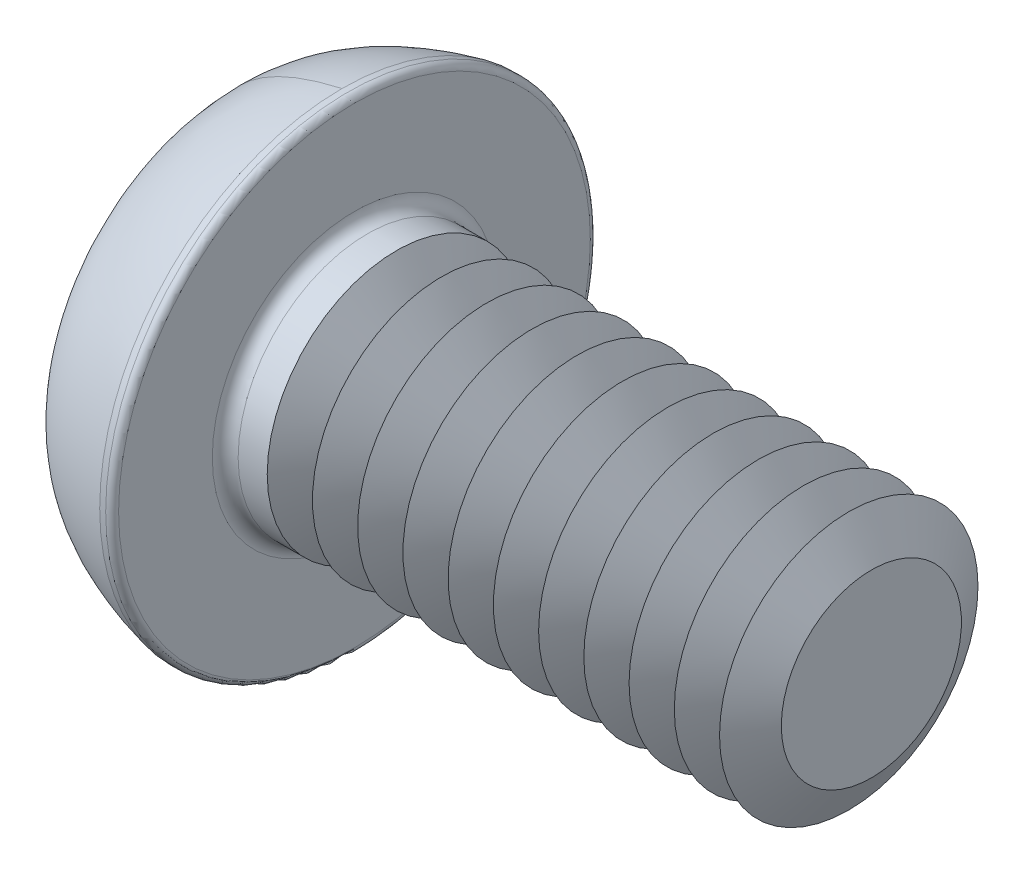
ISO-10303-21;
HEADER;
FILE_DESCRIPTION(('STEP AP214'),'2;1');
FILE_NAME('part.step','',(''),(''),'','','');
FILE_SCHEMA(('AUTOMOTIVE_DESIGN { 1 0 10303 214 1 1 1 1 }'));
ENDSEC;
DATA;
#1=APPLICATION_CONTEXT('core data for automotive mechanical design processes');
#2=APPLICATION_PROTOCOL_DEFINITION('international standard','automotive_design',2000,#1);
#3=PRODUCT_CONTEXT('',#1,'mechanical');
#4=PRODUCT('Part','Part','',(#3));
#5=PRODUCT_RELATED_PRODUCT_CATEGORY('part','',(#4));
#6=PRODUCT_DEFINITION_FORMATION('','',#4);
#7=PRODUCT_DEFINITION_CONTEXT('part definition',#1,'design');
#8=PRODUCT_DEFINITION('design','',#6,#7);
#9=PRODUCT_DEFINITION_SHAPE('','',#8);
#10=(LENGTH_UNIT() NAMED_UNIT(*) SI_UNIT(.MILLI.,.METRE.));
#11=(NAMED_UNIT(*) PLANE_ANGLE_UNIT() SI_UNIT($,.RADIAN.));
#12=(NAMED_UNIT(*) SI_UNIT($,.STERADIAN.) SOLID_ANGLE_UNIT());
#13=UNCERTAINTY_MEASURE_WITH_UNIT(LENGTH_MEASURE(1.E-05),#10,'distance_accuracy_value','');
#14=(GEOMETRIC_REPRESENTATION_CONTEXT(3) GLOBAL_UNCERTAINTY_ASSIGNED_CONTEXT((#13)) GLOBAL_UNIT_ASSIGNED_CONTEXT((#10,
#11,#12)) REPRESENTATION_CONTEXT('',''));
#15=CARTESIAN_POINT('',(0.,0.,0.));
#16=DIRECTION('',(0.,0.,1.));
#17=DIRECTION('',(1.,0.,0.));
#18=AXIS2_PLACEMENT_3D('',#15,#16,#17);
#19=CARTESIAN_POINT('',(0.,2.,0.));
#20=DIRECTION('',(-1.,0.,0.));
#21=DIRECTION('',(0.,0.,1.));
#22=AXIS2_PLACEMENT_3D('',#19,#20,#21);
#23=PLANE('',#22);
#24=CARTESIAN_POINT('',(0.,0.,0.));
#25=DIRECTION('',(-1.,0.,0.));
#26=DIRECTION('',(0.,0.,1.));
#27=AXIS2_PLACEMENT_3D('',#24,#25,#26);
#28=CIRCLE('',#27,1.39378221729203);
#29=CARTESIAN_POINT('',(0.,0.,1.39378221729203));
#30=VERTEX_POINT('',#29);
#31=EDGE_CURVE('E210',#30,#30,#28,.T.);
#32=ORIENTED_EDGE('',*,*,#31,.F.);
#33=EDGE_LOOP('',(#32));
#34=FACE_BOUND('',#33,.T.);
#35=ADVANCED_FACE('F16',(#34),#23,.F.);
#36=CARTESIAN_POINT('',(-0.35000000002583,0.,0.));
#37=DIRECTION('',(-1.,0.,0.));
#38=DIRECTION('',(0.,0.,1.));
#39=AXIS2_PLACEMENT_3D('',#36,#37,#38);
#40=CONICAL_SURFACE('',#39,1.99999999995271,1.04719755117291);
#41=CARTESIAN_POINT('',(-0.35000000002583,0.,0.));
#42=DIRECTION('',(1.,0.,0.));
#43=DIRECTION('',(0.,0.,-1.));
#44=AXIS2_PLACEMENT_3D('',#41,#42,#43);
#45=CIRCLE('',#44,1.99999999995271);
#46=CARTESIAN_POINT('',(-0.35000000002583,0.,-1.99999999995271));
#47=VERTEX_POINT('',#46);
#48=EDGE_CURVE('E207',#47,#47,#45,.F.);
#49=ORIENTED_EDGE('',*,*,#48,.F.);
#50=EDGE_LOOP('',(#49));
#51=FACE_BOUND('',#50,.T.);
#52=ORIENTED_EDGE('',*,*,#31,.T.);
#53=EDGE_LOOP('',(#52));
#54=FACE_BOUND('',#53,.T.);
#55=ADVANCED_FACE('F600',(#51,#54),#40,.T.);
#56=CARTESIAN_POINT('',(-0.35000000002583,0.,0.));
#57=DIRECTION('',(1.,0.,0.));
#58=DIRECTION('',(0.,0.,-1.));
#59=AXIS2_PLACEMENT_3D('',#56,#57,#58);
#60=CONICAL_SURFACE('',#59,1.99999999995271,1.04719755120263);
#61=ORIENTED_EDGE('',*,*,#48,.T.);
#62=EDGE_LOOP('',(#61));
#63=FACE_BOUND('',#62,.T.);
#64=CARTESIAN_POINT('',(-0.699999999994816,0.,0.));
#65=DIRECTION('',(-1.,0.,0.));
#66=DIRECTION('',(0.,0.,1.));
#67=AXIS2_PLACEMENT_3D('',#64,#65,#66);
#68=CIRCLE('',#67,1.39378221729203);
#69=CARTESIAN_POINT('',(-0.699999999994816,0.,1.39378221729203));
#70=VERTEX_POINT('',#69);
#71=EDGE_CURVE('E204',#70,#70,#68,.T.);
#72=ORIENTED_EDGE('',*,*,#71,.F.);
#73=EDGE_LOOP('',(#72));
#74=FACE_BOUND('',#73,.T.);
#75=ADVANCED_FACE('F597',(#63,#74),#60,.T.);
#76=CARTESIAN_POINT('',(-1.05000000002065,0.,0.));
#77=DIRECTION('',(-1.,0.,0.));
#78=DIRECTION('',(0.,0.,1.));
#79=AXIS2_PLACEMENT_3D('',#76,#77,#78);
#80=CONICAL_SURFACE('',#79,1.99999999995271,1.04719755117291);
#81=CARTESIAN_POINT('',(-1.05000000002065,0.,0.));
#82=DIRECTION('',(1.,0.,0.));
#83=DIRECTION('',(0.,0.,-1.));
#84=AXIS2_PLACEMENT_3D('',#81,#82,#83);
#85=CIRCLE('',#84,1.99999999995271);
#86=CARTESIAN_POINT('',(-1.05000000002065,0.,-1.99999999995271));
#87=VERTEX_POINT('',#86);
#88=EDGE_CURVE('E201',#87,#87,#85,.F.);
#89=ORIENTED_EDGE('',*,*,#88,.F.);
#90=EDGE_LOOP('',(#89));
#91=FACE_BOUND('',#90,.T.);
#92=ORIENTED_EDGE('',*,*,#71,.T.);
#93=EDGE_LOOP('',(#92));
#94=FACE_BOUND('',#93,.T.);
#95=ADVANCED_FACE('F593',(#91,#94),#80,.T.);
#96=CARTESIAN_POINT('',(-1.05000000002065,0.,0.));
#97=DIRECTION('',(1.,0.,0.));
#98=DIRECTION('',(0.,0.,-1.));
#99=AXIS2_PLACEMENT_3D('',#96,#97,#98);
#100=CONICAL_SURFACE('',#99,1.99999999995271,1.04719755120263);
#101=ORIENTED_EDGE('',*,*,#88,.T.);
#102=EDGE_LOOP('',(#101));
#103=FACE_BOUND('',#102,.T.);
#104=CARTESIAN_POINT('',(-1.39999999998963,0.,0.));
#105=DIRECTION('',(-1.,0.,0.));
#106=DIRECTION('',(0.,0.,1.));
#107=AXIS2_PLACEMENT_3D('',#104,#105,#106);
#108=CIRCLE('',#107,1.39378221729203);
#109=CARTESIAN_POINT('',(-1.39999999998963,0.,1.39378221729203));
#110=VERTEX_POINT('',#109);
#111=EDGE_CURVE('E198',#110,#110,#108,.T.);
#112=ORIENTED_EDGE('',*,*,#111,.F.);
#113=EDGE_LOOP('',(#112));
#114=FACE_BOUND('',#113,.T.);
#115=ADVANCED_FACE('F589',(#103,#114),#100,.T.);
#116=CARTESIAN_POINT('',(-1.75000000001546,0.,0.));
#117=DIRECTION('',(-1.,0.,0.));
#118=DIRECTION('',(0.,0.,1.));
#119=AXIS2_PLACEMENT_3D('',#116,#117,#118);
#120=CONICAL_SURFACE('',#119,1.99999999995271,1.04719755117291);
#121=CARTESIAN_POINT('',(-1.75000000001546,0.,0.));
#122=DIRECTION('',(1.,0.,0.));
#123=DIRECTION('',(0.,0.,-1.));
#124=AXIS2_PLACEMENT_3D('',#121,#122,#123);
#125=CIRCLE('',#124,1.99999999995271);
#126=CARTESIAN_POINT('',(-1.75000000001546,0.,-1.99999999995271));
#127=VERTEX_POINT('',#126);
#128=EDGE_CURVE('E195',#127,#127,#125,.F.);
#129=ORIENTED_EDGE('',*,*,#128,.F.);
#130=EDGE_LOOP('',(#129));
#131=FACE_BOUND('',#130,.T.);
#132=ORIENTED_EDGE('',*,*,#111,.T.);
#133=EDGE_LOOP('',(#132));
#134=FACE_BOUND('',#133,.T.);
#135=ADVANCED_FACE('F585',(#131,#134),#120,.T.);
#136=CARTESIAN_POINT('',(-1.75000000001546,0.,0.));
#137=DIRECTION('',(1.,0.,0.));
#138=DIRECTION('',(0.,0.,-1.));
#139=AXIS2_PLACEMENT_3D('',#136,#137,#138);
#140=CONICAL_SURFACE('',#139,1.99999999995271,1.04719755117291);
#141=ORIENTED_EDGE('',*,*,#128,.T.);
#142=EDGE_LOOP('',(#141));
#143=FACE_BOUND('',#142,.T.);
#144=CARTESIAN_POINT('',(-2.10000000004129,0.,0.));
#145=DIRECTION('',(-1.,0.,0.));
#146=DIRECTION('',(0.,0.,1.));
#147=AXIS2_PLACEMENT_3D('',#144,#145,#146);
#148=CIRCLE('',#147,1.39378221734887);
#149=CARTESIAN_POINT('',(-2.10000000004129,0.,1.39378221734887));
#150=VERTEX_POINT('',#149);
#151=EDGE_CURVE('E192',#150,#150,#148,.T.);
#152=ORIENTED_EDGE('',*,*,#151,.F.);
#153=EDGE_LOOP('',(#152));
#154=FACE_BOUND('',#153,.T.);
#155=ADVANCED_FACE('F581',(#143,#154),#140,.T.);
#156=CARTESIAN_POINT('',(-2.45000000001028,0.,0.));
#157=DIRECTION('',(-1.,0.,0.));
#158=DIRECTION('',(0.,0.,1.));
#159=AXIS2_PLACEMENT_3D('',#156,#157,#158);
#160=CONICAL_SURFACE('',#159,1.99999999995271,1.04719755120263);
#161=CARTESIAN_POINT('',(-2.45000000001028,0.,0.));
#162=DIRECTION('',(1.,0.,0.));
#163=DIRECTION('',(0.,0.,-1.));
#164=AXIS2_PLACEMENT_3D('',#161,#162,#163);
#165=CIRCLE('',#164,1.99999999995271);
#166=CARTESIAN_POINT('',(-2.45000000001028,0.,-1.99999999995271));
#167=VERTEX_POINT('',#166);
#168=EDGE_CURVE('E189',#167,#167,#165,.F.);
#169=ORIENTED_EDGE('',*,*,#168,.F.);
#170=EDGE_LOOP('',(#169));
#171=FACE_BOUND('',#170,.T.);
#172=ORIENTED_EDGE('',*,*,#151,.T.);
#173=EDGE_LOOP('',(#172));
#174=FACE_BOUND('',#173,.T.);
#175=ADVANCED_FACE('F577',(#171,#174),#160,.T.);
#176=CARTESIAN_POINT('',(-2.45000000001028,0.,0.));
#177=DIRECTION('',(1.,0.,0.));
#178=DIRECTION('',(0.,0.,-1.));
#179=AXIS2_PLACEMENT_3D('',#176,#177,#178);
#180=CONICAL_SURFACE('',#179,1.99999999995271,1.04719755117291);
#181=ORIENTED_EDGE('',*,*,#168,.T.);
#182=EDGE_LOOP('',(#181));
#183=FACE_BOUND('',#182,.T.);
#184=CARTESIAN_POINT('',(-2.80000000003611,0.,0.));
#185=DIRECTION('',(-1.,0.,0.));
#186=DIRECTION('',(0.,0.,1.));
#187=AXIS2_PLACEMENT_3D('',#184,#185,#186);
#188=CIRCLE('',#187,1.39378221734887);
#189=CARTESIAN_POINT('',(-2.80000000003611,0.,1.39378221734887));
#190=VERTEX_POINT('',#189);
#191=EDGE_CURVE('E186',#190,#190,#188,.T.);
#192=ORIENTED_EDGE('',*,*,#191,.F.);
#193=EDGE_LOOP('',(#192));
#194=FACE_BOUND('',#193,.T.);
#195=ADVANCED_FACE('F573',(#183,#194),#180,.T.);
#196=CARTESIAN_POINT('',(-3.14999999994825,0.,0.));
#197=DIRECTION('',(-1.,0.,0.));
#198=DIRECTION('',(0.,0.,1.));
#199=AXIS2_PLACEMENT_3D('',#196,#197,#198);
#200=CONICAL_SURFACE('',#199,1.99999999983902,1.04719755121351);
#201=CARTESIAN_POINT('',(-3.15000000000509,0.,0.));
#202=DIRECTION('',(1.,0.,0.));
#203=DIRECTION('',(0.,0.,-1.));
#204=AXIS2_PLACEMENT_3D('',#201,#202,#203);
#205=CIRCLE('',#204,1.99999999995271);
#206=CARTESIAN_POINT('',(-3.15000000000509,0.,-1.99999999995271));
#207=VERTEX_POINT('',#206);
#208=EDGE_CURVE('E183',#207,#207,#205,.F.);
#209=ORIENTED_EDGE('',*,*,#208,.F.);
#210=EDGE_LOOP('',(#209));
#211=FACE_BOUND('',#210,.T.);
#212=ORIENTED_EDGE('',*,*,#191,.T.);
#213=EDGE_LOOP('',(#212));
#214=FACE_BOUND('',#213,.T.);
#215=ADVANCED_FACE('F569',(#211,#214),#200,.T.);
#216=CARTESIAN_POINT('',(-3.15000000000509,0.,0.));
#217=DIRECTION('',(1.,0.,0.));
#218=DIRECTION('',(0.,1.,0.));
#219=AXIS2_PLACEMENT_3D('',#216,#217,#218);
#220=CONICAL_SURFACE('',#219,1.99999999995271,1.04719755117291);
#221=ORIENTED_EDGE('',*,*,#208,.T.);
#222=EDGE_LOOP('',(#221));
#223=FACE_BOUND('',#222,.T.);
#224=CARTESIAN_POINT('',(-3.50000000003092,0.,0.));
#225=DIRECTION('',(-1.,0.,0.));
#226=DIRECTION('',(0.,0.,1.));
#227=AXIS2_PLACEMENT_3D('',#224,#225,#226);
#228=CIRCLE('',#227,1.39378221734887);
#229=CARTESIAN_POINT('',(-3.50000000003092,0.,1.39378221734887));
#230=VERTEX_POINT('',#229);
#231=EDGE_CURVE('E180',#230,#230,#228,.T.);
#232=ORIENTED_EDGE('',*,*,#231,.F.);
#233=EDGE_LOOP('',(#232));
#234=FACE_BOUND('',#233,.T.);
#235=ADVANCED_FACE('F565',(#223,#234),#220,.T.);
#236=CARTESIAN_POINT('',(-3.84999999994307,0.,0.));
#237=DIRECTION('',(-1.,0.,0.));
#238=DIRECTION('',(0.,-1.,0.));
#239=AXIS2_PLACEMENT_3D('',#236,#237,#238);
#240=CONICAL_SURFACE('',#239,1.99999999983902,1.04719755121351);
#241=CARTESIAN_POINT('',(-3.84999999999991,0.,0.));
#242=DIRECTION('',(1.,0.,0.));
#243=DIRECTION('',(0.,0.,-1.));
#244=AXIS2_PLACEMENT_3D('',#241,#242,#243);
#245=CIRCLE('',#244,2.00000000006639);
#246=CARTESIAN_POINT('',(-3.84999999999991,0.,-2.00000000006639));
#247=VERTEX_POINT('',#246);
#248=EDGE_CURVE('E177',#247,#247,#245,.F.);
#249=ORIENTED_EDGE('',*,*,#248,.F.);
#250=EDGE_LOOP('',(#249));
#251=FACE_BOUND('',#250,.T.);
#252=ORIENTED_EDGE('',*,*,#231,.T.);
#253=EDGE_LOOP('',(#252));
#254=FACE_BOUND('',#253,.T.);
#255=ADVANCED_FACE('F561',(#251,#254),#240,.T.);
#256=CARTESIAN_POINT('',(-3.85000000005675,0.,0.));
#257=DIRECTION('',(1.,0.,0.));
#258=DIRECTION('',(0.,0.,-1.));
#259=AXIS2_PLACEMENT_3D('',#256,#257,#258);
#260=CONICAL_SURFACE('',#259,1.99999999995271,1.04719755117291);
#261=ORIENTED_EDGE('',*,*,#248,.T.);
#262=EDGE_LOOP('',(#261));
#263=FACE_BOUND('',#262,.T.);
#264=CARTESIAN_POINT('',(-4.20000000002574,0.,0.));
#265=DIRECTION('',(-1.,0.,0.));
#266=DIRECTION('',(0.,0.,1.));
#267=AXIS2_PLACEMENT_3D('',#264,#265,#266);
#268=CIRCLE('',#267,1.39378221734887);
#269=CARTESIAN_POINT('',(-4.20000000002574,0.,1.39378221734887));
#270=VERTEX_POINT('',#269);
#271=EDGE_CURVE('E174',#270,#270,#268,.T.);
#272=ORIENTED_EDGE('',*,*,#271,.F.);
#273=EDGE_LOOP('',(#272));
#274=FACE_BOUND('',#273,.T.);
#275=ADVANCED_FACE('F557',(#263,#274),#260,.T.);
#276=CARTESIAN_POINT('',(-4.54999999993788,0.,0.));
#277=DIRECTION('',(-1.,0.,0.));
#278=DIRECTION('',(0.,0.,1.));
#279=AXIS2_PLACEMENT_3D('',#276,#277,#278);
#280=CONICAL_SURFACE('',#279,1.99999999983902,1.04719755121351);
#281=CARTESIAN_POINT('',(-4.54999999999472,0.,0.));
#282=DIRECTION('',(1.,0.,0.));
#283=DIRECTION('',(0.,0.,-1.));
#284=AXIS2_PLACEMENT_3D('',#281,#282,#283);
#285=CIRCLE('',#284,2.00000000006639);
#286=CARTESIAN_POINT('',(-4.54999999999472,0.,-2.00000000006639));
#287=VERTEX_POINT('',#286);
#288=EDGE_CURVE('E171',#287,#287,#285,.F.);
#289=ORIENTED_EDGE('',*,*,#288,.F.);
#290=EDGE_LOOP('',(#289));
#291=FACE_BOUND('',#290,.T.);
#292=ORIENTED_EDGE('',*,*,#271,.T.);
#293=EDGE_LOOP('',(#292));
#294=FACE_BOUND('',#293,.T.);
#295=ADVANCED_FACE('F553',(#291,#294),#280,.T.);
#296=CARTESIAN_POINT('',(-4.55000000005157,0.,0.));
#297=DIRECTION('',(1.,0.,0.));
#298=DIRECTION('',(0.,0.,-1.));
#299=AXIS2_PLACEMENT_3D('',#296,#297,#298);
#300=CONICAL_SURFACE('',#299,1.99999999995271,1.04719755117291);
#301=ORIENTED_EDGE('',*,*,#288,.T.);
#302=EDGE_LOOP('',(#301));
#303=FACE_BOUND('',#302,.T.);
#304=CARTESIAN_POINT('',(-4.90000000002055,0.,0.));
#305=DIRECTION('',(-1.,0.,0.));
#306=DIRECTION('',(0.,0.,1.));
#307=AXIS2_PLACEMENT_3D('',#304,#305,#306);
#308=CIRCLE('',#307,1.39378221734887);
#309=CARTESIAN_POINT('',(-4.90000000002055,0.,1.39378221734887));
#310=VERTEX_POINT('',#309);
#311=EDGE_CURVE('E168',#310,#310,#308,.T.);
#312=ORIENTED_EDGE('',*,*,#311,.F.);
#313=EDGE_LOOP('',(#312));
#314=FACE_BOUND('',#313,.T.);
#315=ADVANCED_FACE('F549',(#303,#314),#300,.T.);
#316=CARTESIAN_POINT('',(-5.2499999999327,0.,0.));
#317=DIRECTION('',(-1.,0.,0.));
#318=DIRECTION('',(0.,0.,1.));
#319=AXIS2_PLACEMENT_3D('',#316,#317,#318);
#320=CONICAL_SURFACE('',#319,1.99999999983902,1.04719755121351);
#321=CARTESIAN_POINT('',(-5.24999999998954,0.,0.));
#322=DIRECTION('',(1.,0.,0.));
#323=DIRECTION('',(0.,0.,-1.));
#324=AXIS2_PLACEMENT_3D('',#321,#322,#323);
#325=CIRCLE('',#324,2.00000000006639);
#326=CARTESIAN_POINT('',(-5.24999999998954,0.,-2.00000000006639));
#327=VERTEX_POINT('',#326);
#328=EDGE_CURVE('E165',#327,#327,#325,.F.);
#329=ORIENTED_EDGE('',*,*,#328,.F.);
#330=EDGE_LOOP('',(#329));
#331=FACE_BOUND('',#330,.T.);
#332=ORIENTED_EDGE('',*,*,#311,.T.);
#333=EDGE_LOOP('',(#332));
#334=FACE_BOUND('',#333,.T.);
#335=ADVANCED_FACE('F545',(#331,#334),#320,.T.);
#336=CARTESIAN_POINT('',(-5.25000000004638,0.,0.));
#337=DIRECTION('',(1.,0.,0.));
#338=DIRECTION('',(0.,0.,-1.));
#339=AXIS2_PLACEMENT_3D('',#336,#337,#338);
#340=CONICAL_SURFACE('',#339,1.99999999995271,1.04719755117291);
#341=ORIENTED_EDGE('',*,*,#328,.T.);
#342=EDGE_LOOP('',(#341));
#343=FACE_BOUND('',#342,.T.);
#344=CARTESIAN_POINT('',(-5.60000000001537,0.,0.));
#345=DIRECTION('',(-1.,0.,0.));
#346=DIRECTION('',(0.,0.,1.));
#347=AXIS2_PLACEMENT_3D('',#344,#345,#346);
#348=CIRCLE('',#347,1.39378221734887);
#349=CARTESIAN_POINT('',(-5.60000000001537,0.,1.39378221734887));
#350=VERTEX_POINT('',#349);
#351=EDGE_CURVE('E162',#350,#350,#348,.T.);
#352=ORIENTED_EDGE('',*,*,#351,.F.);
#353=EDGE_LOOP('',(#352));
#354=FACE_BOUND('',#353,.T.);
#355=ADVANCED_FACE('F541',(#343,#354),#340,.T.);
#356=CARTESIAN_POINT('',(-5.94999999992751,0.,0.));
#357=DIRECTION('',(-1.,0.,0.));
#358=DIRECTION('',(0.,0.,1.));
#359=AXIS2_PLACEMENT_3D('',#356,#357,#358);
#360=CONICAL_SURFACE('',#359,1.99999999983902,1.04719755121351);
#361=CARTESIAN_POINT('',(-5.9500000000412,0.,0.));
#362=DIRECTION('',(1.,0.,0.));
#363=DIRECTION('',(0.,0.,-1.));
#364=AXIS2_PLACEMENT_3D('',#361,#362,#363);
#365=CIRCLE('',#364,1.99999999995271);
#366=CARTESIAN_POINT('',(-5.9500000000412,0.,-1.99999999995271));
#367=VERTEX_POINT('',#366);
#368=EDGE_CURVE('E159',#367,#367,#365,.F.);
#369=ORIENTED_EDGE('',*,*,#368,.F.);
#370=EDGE_LOOP('',(#369));
#371=FACE_BOUND('',#370,.T.);
#372=ORIENTED_EDGE('',*,*,#351,.T.);
#373=EDGE_LOOP('',(#372));
#374=FACE_BOUND('',#373,.T.);
#375=ADVANCED_FACE('F537',(#371,#374),#360,.T.);
#376=CARTESIAN_POINT('',(-5.9500000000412,0.,0.));
#377=DIRECTION('',(1.,0.,0.));
#378=DIRECTION('',(0.,1.,0.));
#379=AXIS2_PLACEMENT_3D('',#376,#377,#378);
#380=CONICAL_SURFACE('',#379,1.99999999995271,1.04719755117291);
#381=ORIENTED_EDGE('',*,*,#368,.T.);
#382=EDGE_LOOP('',(#381));
#383=FACE_BOUND('',#382,.T.);
#384=CARTESIAN_POINT('',(-6.30000000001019,0.,0.));
#385=DIRECTION('',(-1.,0.,0.));
#386=DIRECTION('',(0.,0.,1.));
#387=AXIS2_PLACEMENT_3D('',#384,#385,#386);
#388=CIRCLE('',#387,1.39378221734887);
#389=CARTESIAN_POINT('',(-6.30000000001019,0.,1.39378221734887));
#390=VERTEX_POINT('',#389);
#391=EDGE_CURVE('E156',#390,#390,#388,.T.);
#392=ORIENTED_EDGE('',*,*,#391,.F.);
#393=EDGE_LOOP('',(#392));
#394=FACE_BOUND('',#393,.T.);
#395=ADVANCED_FACE('F531',(#383,#394),#380,.T.);
#396=CARTESIAN_POINT('',(-6.64999999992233,0.,0.));
#397=DIRECTION('',(-1.,0.,0.));
#398=DIRECTION('',(0.,0.,1.));
#399=AXIS2_PLACEMENT_3D('',#396,#397,#398);
#400=CONICAL_SURFACE('',#399,1.99999999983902,1.04719755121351);
#401=CARTESIAN_POINT('',(-6.65000000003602,0.,0.));
#402=DIRECTION('',(1.,0.,0.));
#403=DIRECTION('',(0.,0.,-1.));
#404=AXIS2_PLACEMENT_3D('',#401,#402,#403);
#405=CIRCLE('',#404,1.99999999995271);
#406=CARTESIAN_POINT('',(-6.65000000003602,0.,-1.99999999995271));
#407=VERTEX_POINT('',#406);
#408=EDGE_CURVE('E153',#407,#407,#405,.F.);
#409=ORIENTED_EDGE('',*,*,#408,.F.);
#410=EDGE_LOOP('',(#409));
#411=FACE_BOUND('',#410,.T.);
#412=ORIENTED_EDGE('',*,*,#391,.T.);
#413=EDGE_LOOP('',(#412));
#414=FACE_BOUND('',#413,.T.);
#415=ADVANCED_FACE('F525',(#411,#414),#400,.T.);
#416=CARTESIAN_POINT('',(-6.65000000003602,0.,0.));
#417=DIRECTION('',(1.,0.,0.));
#418=DIRECTION('',(0.,0.,-1.));
#419=AXIS2_PLACEMENT_3D('',#416,#417,#418);
#420=CONICAL_SURFACE('',#419,1.99999999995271,1.04719755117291);
#421=ORIENTED_EDGE('',*,*,#408,.T.);
#422=EDGE_LOOP('',(#421));
#423=FACE_BOUND('',#422,.T.);
#424=CARTESIAN_POINT('',(-7.000000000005,0.,0.));
#425=DIRECTION('',(-1.,0.,0.));
#426=DIRECTION('',(0.,0.,1.));
#427=AXIS2_PLACEMENT_3D('',#424,#425,#426);
#428=CIRCLE('',#427,1.39378221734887);
#429=CARTESIAN_POINT('',(-7.000000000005,0.,1.39378221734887));
#430=VERTEX_POINT('',#429);
#431=EDGE_CURVE('E150',#430,#430,#428,.T.);
#432=ORIENTED_EDGE('',*,*,#431,.F.);
#433=EDGE_LOOP('',(#432));
#434=FACE_BOUND('',#433,.T.);
#435=ADVANCED_FACE('F520',(#423,#434),#420,.T.);
#436=CARTESIAN_POINT('',(-7.34999999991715,0.,0.));
#437=DIRECTION('',(-1.,0.,0.));
#438=DIRECTION('',(0.,-1.,0.));
#439=AXIS2_PLACEMENT_3D('',#436,#437,#438);
#440=CONICAL_SURFACE('',#439,1.99999999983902,1.04719755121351);
#441=CARTESIAN_POINT('',(-7.35,0.,0.));
#442=DIRECTION('',(-1.,0.,0.));
#443=DIRECTION('',(0.,0.,1.));
#444=AXIS2_PLACEMENT_3D('',#441,#442,#443);
#445=CIRCLE('',#444,2.);
#446=CARTESIAN_POINT('',(-7.35,0.,2.));
#447=VERTEX_POINT('',#446);
#448=EDGE_CURVE('E147',#447,#447,#445,.T.);
#449=ORIENTED_EDGE('',*,*,#448,.F.);
#450=EDGE_LOOP('',(#449));
#451=FACE_BOUND('',#450,.T.);
#452=ORIENTED_EDGE('',*,*,#431,.T.);
#453=EDGE_LOOP('',(#452));
#454=FACE_BOUND('',#453,.T.);
#455=ADVANCED_FACE('F515',(#451,#454),#440,.T.);
#456=CARTESIAN_POINT('',(-10.2,0.,0.));
#457=DIRECTION('',(-1.,0.,0.));
#458=DIRECTION('',(0.,0.,1.));
#459=AXIS2_PLACEMENT_3D('',#456,#457,#458);
#460=CYLINDRICAL_SURFACE('',#459,2.);
#461=CARTESIAN_POINT('',(-7.8,0.,0.));
#462=DIRECTION('',(-1.,0.,0.));
#463=DIRECTION('',(0.,0.,1.));
#464=AXIS2_PLACEMENT_3D('',#461,#462,#463);
#465=CIRCLE('',#464,2.);
#466=CARTESIAN_POINT('',(-7.8,0.,2.));
#467=VERTEX_POINT('',#466);
#468=EDGE_CURVE('E112',#467,#467,#465,.F.);
#469=ORIENTED_EDGE('',*,*,#468,.T.);
#470=EDGE_LOOP('',(#469));
#471=FACE_BOUND('',#470,.T.);
#472=ORIENTED_EDGE('',*,*,#448,.T.);
#473=EDGE_LOOP('',(#472));
#474=FACE_BOUND('',#473,.T.);
#475=ADVANCED_FACE('F512',(#471,#474),#460,.T.);
#476=CARTESIAN_POINT('',(-8.90540000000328,0.,0.));
#477=DIRECTION('',(-1.,0.,0.));
#478=DIRECTION('',(0.,0.,1.));
#479=AXIS2_PLACEMENT_3D('',#476,#477,#478);
#480=CONICAL_SURFACE('',#479,1.45203592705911,1.01324881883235);
#481=CARTESIAN_POINT('',(-7.99999999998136,0.,8.5265128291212E-11));
#482=VERTEX_POINT('',#481);
#483=VERTEX_LOOP('',#482);
#484=FACE_BOUND('',#483,.T.);
#485=CARTESIAN_POINT('',(-8.8999999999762,1.44337567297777,6.42488806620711E-12));
#486=CARTESIAN_POINT('',(-8.88007872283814,1.41143450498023,-0.0553237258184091));
#487=CARTESIAN_POINT('',(-8.86194472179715,1.37917173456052,-0.111204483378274));
#488=CARTESIAN_POINT('',(-8.83031020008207,1.31399030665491,-0.224102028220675));
#489=CARTESIAN_POINT('',(-8.81682328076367,1.28107001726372,-0.281121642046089));
#490=CARTESIAN_POINT('',(-8.79597614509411,1.21570590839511,-0.394335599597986));
#491=CARTESIAN_POINT('',(-8.78845008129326,1.18327582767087,-0.45050614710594));
#492=CARTESIAN_POINT('',(-8.77965673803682,1.11824560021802,-0.563141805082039));
#493=CARTESIAN_POINT('',(-8.77838010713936,1.08564578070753,-0.619606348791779));
#494=CARTESIAN_POINT('',(-8.78191426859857,1.02531363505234,-0.724104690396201));
#495=CARTESIAN_POINT('',(-8.78586113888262,0.997567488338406,-0.772162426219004));
#496=CARTESIAN_POINT('',(-8.79808262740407,0.942287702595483,-0.867909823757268));
#497=CARTESIAN_POINT('',(-8.80636197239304,0.914754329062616,-0.915599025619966));
#498=CARTESIAN_POINT('',(-8.82695101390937,0.859348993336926,-1.01156388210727));
#499=CARTESIAN_POINT('',(-8.83935820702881,0.831486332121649,-1.05982342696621));
#500=CARTESIAN_POINT('',(-8.86741853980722,0.77623810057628,-1.15551617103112));
#501=CARTESIAN_POINT('',(-8.88306409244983,0.748851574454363,-1.20295102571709));
#502=CARTESIAN_POINT('',(-8.90000000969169,0.72168782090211,-1.25000002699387));
#503=B_SPLINE_CURVE_WITH_KNOTS('',3,(#485,#486,#487,#488,#489,#490,#491,#492,#493,#494,#495,
#496,#497,#498,#499,#500,#501,#502),.UNSPECIFIED.,.F.,.F.,(4,2,2,2,2,2,2,2,4),(0.,
0.200848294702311,0.40227954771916,0.597887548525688,0.793202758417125,0.959920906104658,
1.12682132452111,1.29798261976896,1.46874735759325),.UNSPECIFIED.);
#504=CARTESIAN_POINT('',(-8.8999999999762,1.44337567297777,0.));
#505=VERTEX_POINT('',#504);
#506=CARTESIAN_POINT('',(-8.89999999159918,0.721687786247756,-1.25000001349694));
#507=VERTEX_POINT('',#506);
#508=EDGE_CURVE('E299',#505,#507,#503,.T.);
#509=ORIENTED_EDGE('',*,*,#508,.T.);
#510=CARTESIAN_POINT('',(-8.89999997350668,0.721687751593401,-1.25));
#511=CARTESIAN_POINT('',(-8.88157314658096,0.662585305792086,-1.25));
#512=CARTESIAN_POINT('',(-8.86467414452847,0.60294462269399,-1.25));
#513=CARTESIAN_POINT('',(-8.83476992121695,0.482535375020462,-1.25));
#514=CARTESIAN_POINT('',(-8.82177519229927,0.421764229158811,-1.25));
#515=CARTESIAN_POINT('',(-8.80091035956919,0.30100893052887,-1.25));
#516=CARTESIAN_POINT('',(-8.79291152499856,0.241047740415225,-1.25));
#517=CARTESIAN_POINT('',(-8.78217121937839,0.12072394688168,-1.25));
#518=CARTESIAN_POINT('',(-8.77942286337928,0.0603619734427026,-1.25));
#519=CARTESIAN_POINT('',(-8.7794228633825,-0.0603619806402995,-1.25));
#520=CARTESIAN_POINT('',(-8.78217122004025,-0.120723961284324,-1.25));
#521=CARTESIAN_POINT('',(-8.79291152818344,-0.241047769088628,-1.25));
#522=CARTESIAN_POINT('',(-8.8009103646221,-0.301008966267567,-1.25));
#523=CARTESIAN_POINT('',(-8.82177520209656,-0.421764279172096,-1.25));
#524=CARTESIAN_POINT('',(-8.83476993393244,-0.482535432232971,-1.25));
#525=CARTESIAN_POINT('',(-8.86467416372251,-0.602944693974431,-1.25));
#526=CARTESIAN_POINT('',(-8.88157316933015,-0.662585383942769,-1.25));
#527=CARTESIAN_POINT('',(-8.89999999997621,-0.721687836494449,-1.25));
#528=B_SPLINE_CURVE_WITH_KNOTS('',3,(#510,#511,#512,#513,#514,#515,#516,#517,#518,#519,#520,
#521,#522,#523,#524,#525,#526,#527),.UNSPECIFIED.,.F.,.F.,(4,2,2,2,2,2,2,2,4),(0.,
0.185794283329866,0.372083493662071,0.553349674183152,0.734377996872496,0.915406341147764,
1.09667254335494,1.28296177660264,1.46875608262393),.UNSPECIFIED.);
#529=CARTESIAN_POINT('',(-8.89999999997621,-0.721687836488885,-1.25000000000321));
#530=VERTEX_POINT('',#529);
#531=EDGE_CURVE('E308',#507,#530,#528,.T.);
#532=ORIENTED_EDGE('',*,*,#531,.T.);
#533=CARTESIAN_POINT('',(-8.89999999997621,-0.721687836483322,-1.25000000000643));
#534=CARTESIAN_POINT('',(-8.88007872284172,-0.753629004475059,-1.19467627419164));
#535=CARTESIAN_POINT('',(-8.86194472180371,-0.785891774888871,-1.13879551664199));
#536=CARTESIAN_POINT('',(-8.83031020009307,-0.851073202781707,-1.02589797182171));
#537=CARTESIAN_POINT('',(-8.81682328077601,-0.883993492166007,-0.968878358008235));
#538=CARTESIAN_POINT('',(-8.7959761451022,-0.9493576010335,-0.855664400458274));
#539=CARTESIAN_POINT('',(-8.78845008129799,-0.981787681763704,-0.799493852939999));
#540=CARTESIAN_POINT('',(-8.7796567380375,-1.04681790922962,-0.686858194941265));
#541=CARTESIAN_POINT('',(-8.77838010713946,-1.07941772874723,-0.630393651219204));
#542=CARTESIAN_POINT('',(-8.78191426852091,-1.13974987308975,-0.525895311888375));
#543=CARTESIAN_POINT('',(-8.78586113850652,-1.16749601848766,-0.477837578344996));
#544=CARTESIAN_POINT('',(-8.79808262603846,-1.22277580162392,-0.382090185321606));
#545=CARTESIAN_POINT('',(-8.80636197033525,-1.25030917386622,-0.334400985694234));
#546=CARTESIAN_POINT('',(-8.82695101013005,-1.30571450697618,-0.238436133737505));
#547=CARTESIAN_POINT('',(-8.83935820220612,-1.33357716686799,-0.190176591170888));
#548=CARTESIAN_POINT('',(-8.86741853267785,-1.38882539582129,-0.0944838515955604));
#549=CARTESIAN_POINT('',(-8.88306408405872,-1.41621192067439,-0.0470489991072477));
#550=CARTESIAN_POINT('',(-8.8999999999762,-1.44337567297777,6.42325147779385E-12));
#551=B_SPLINE_CURVE_WITH_KNOTS('',3,(#533,#534,#535,#536,#537,#538,#539,#540,#541,#542,#543,
#544,#545,#546,#547,#548,#549,#550),.UNSPECIFIED.,.F.,.F.,(4,2,2,2,2,2,2,2,4),(0.,
0.200848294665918,0.402279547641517,0.59788754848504,0.793202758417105,0.959920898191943,
1.12682130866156,1.29798259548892,1.46874732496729),.UNSPECIFIED.);
#552=CARTESIAN_POINT('',(-8.89999999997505,-1.44337567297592,-3.21287979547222E-12));
#553=VERTEX_POINT('',#552);
#554=EDGE_CURVE('E108',#530,#553,#551,.T.);
#555=ORIENTED_EDGE('',*,*,#554,.T.);
#556=CARTESIAN_POINT('',(-8.8999999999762,-1.44337567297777,-6.42510882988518E-12));
#557=CARTESIAN_POINT('',(-8.88007872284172,-1.41143450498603,0.055323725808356));
#558=CARTESIAN_POINT('',(-8.86194472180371,-1.37917173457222,0.111204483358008));
#559=CARTESIAN_POINT('',(-8.83031020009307,-1.31399030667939,0.224102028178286));
#560=CARTESIAN_POINT('',(-8.81682328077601,-1.28107001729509,0.281121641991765));
#561=CARTESIAN_POINT('',(-8.7959761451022,-1.21570590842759,0.394335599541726));
#562=CARTESIAN_POINT('',(-8.78845008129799,-1.18327582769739,0.450506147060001));
#563=CARTESIAN_POINT('',(-8.7796567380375,-1.11824560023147,0.563141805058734));
#564=CARTESIAN_POINT('',(-8.77838010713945,-1.08564578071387,0.619606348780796));
#565=CARTESIAN_POINT('',(-8.7819142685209,-1.02531363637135,0.724104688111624));
#566=CARTESIAN_POINT('',(-8.78586113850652,-0.997567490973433,0.772162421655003));
#567=CARTESIAN_POINT('',(-8.79808262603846,-0.942287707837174,0.867909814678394));
#568=CARTESIAN_POINT('',(-8.80636197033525,-0.914754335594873,0.915599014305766));
#569=CARTESIAN_POINT('',(-8.82695101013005,-0.859349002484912,1.0115638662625));
#570=CARTESIAN_POINT('',(-8.83935820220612,-0.831486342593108,1.05982340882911));
#571=CARTESIAN_POINT('',(-8.86741853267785,-0.776238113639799,1.15551614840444));
#572=CARTESIAN_POINT('',(-8.88306408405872,-0.748851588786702,1.20295100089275));
#573=CARTESIAN_POINT('',(-8.8999999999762,-0.721687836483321,1.25000000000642));
#574=B_SPLINE_CURVE_WITH_KNOTS('',3,(#556,#557,#558,#559,#560,#561,#562,#563,#564,#565,#566,
#567,#568,#569,#570,#571,#572,#573),.UNSPECIFIED.,.F.,.F.,(4,2,2,2,2,2,2,2,4),(0.,
0.200848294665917,0.402279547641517,0.597887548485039,0.793202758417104,0.959920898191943,
1.12682130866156,1.29798259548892,1.46874732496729),.UNSPECIFIED.);
#575=CARTESIAN_POINT('',(-8.8999999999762,-0.721687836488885,1.25000000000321));
#576=VERTEX_POINT('',#575);
#577=EDGE_CURVE('E104',#553,#576,#574,.T.);
#578=ORIENTED_EDGE('',*,*,#577,.T.);
#579=CARTESIAN_POINT('',(-8.89999999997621,-0.721687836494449,1.25));
#580=CARTESIAN_POINT('',(-8.88157316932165,-0.662585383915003,1.25));
#581=CARTESIAN_POINT('',(-8.86467416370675,-0.602944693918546,1.25));
#582=CARTESIAN_POINT('',(-8.83476993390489,-0.482535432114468,1.25));
#583=CARTESIAN_POINT('',(-8.82177520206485,-0.421764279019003,1.25));
#584=CARTESIAN_POINT('',(-8.80091036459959,-0.301008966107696,1.25));
#585=CARTESIAN_POINT('',(-8.79291152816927,-0.241047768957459,1.25));
#586=CARTESIAN_POINT('',(-8.78217122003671,-0.120723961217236,1.25));
#587=CARTESIAN_POINT('',(-8.77942286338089,-0.060361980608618,1.25));
#588=CARTESIAN_POINT('',(-8.77942286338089,0.0603619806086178,1.25));
#589=CARTESIAN_POINT('',(-8.78217122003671,0.120723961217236,1.25));
#590=CARTESIAN_POINT('',(-8.79291152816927,0.241047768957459,1.25));
#591=CARTESIAN_POINT('',(-8.80091036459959,0.301008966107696,1.25));
#592=CARTESIAN_POINT('',(-8.82177520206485,0.421764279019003,1.25));
#593=CARTESIAN_POINT('',(-8.83476993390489,0.482535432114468,1.25));
#594=CARTESIAN_POINT('',(-8.86467416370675,0.602944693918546,1.25));
#595=CARTESIAN_POINT('',(-8.88157316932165,0.662585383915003,1.25));
#596=CARTESIAN_POINT('',(-8.89999999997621,0.721687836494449,1.25));
#597=B_SPLINE_CURVE_WITH_KNOTS('',3,(#579,#580,#581,#582,#583,#584,#585,#586,#587,#588,#589,
#590,#591,#592,#593,#594,#595,#596),.UNSPECIFIED.,.F.,.F.,(4,2,2,2,2,2,2,2,4),(0.,
0.185794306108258,0.372083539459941,0.553349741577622,0.734378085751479,0.915406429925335,
1.09667263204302,1.2829618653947,1.46875617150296),.UNSPECIFIED.);
#598=CARTESIAN_POINT('',(-8.89999999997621,0.721687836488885,1.25000000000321));
#599=VERTEX_POINT('',#598);
#600=EDGE_CURVE('E92',#576,#599,#597,.T.);
#601=ORIENTED_EDGE('',*,*,#600,.T.);
#602=CARTESIAN_POINT('',(-8.89999999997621,0.721687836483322,1.25000000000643));
#603=CARTESIAN_POINT('',(-8.88007872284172,0.753629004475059,1.19467627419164));
#604=CARTESIAN_POINT('',(-8.86194472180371,0.785891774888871,1.13879551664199));
#605=CARTESIAN_POINT('',(-8.83031020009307,0.851073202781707,1.02589797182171));
#606=CARTESIAN_POINT('',(-8.81682328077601,0.883993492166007,0.968878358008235));
#607=CARTESIAN_POINT('',(-8.7959761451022,0.9493576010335,0.855664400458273));
#608=CARTESIAN_POINT('',(-8.78845008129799,0.981787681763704,0.799493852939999));
#609=CARTESIAN_POINT('',(-8.7796567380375,1.04681790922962,0.686858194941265));
#610=CARTESIAN_POINT('',(-8.77838010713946,1.07941772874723,0.630393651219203));
#611=CARTESIAN_POINT('',(-8.78191426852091,1.13974987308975,0.525895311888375));
#612=CARTESIAN_POINT('',(-8.78586113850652,1.16749601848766,0.477837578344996));
#613=CARTESIAN_POINT('',(-8.79808262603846,1.22277580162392,0.382090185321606));
#614=CARTESIAN_POINT('',(-8.80636197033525,1.25030917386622,0.334400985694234));
#615=CARTESIAN_POINT('',(-8.82695101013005,1.30571450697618,0.238436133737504));
#616=CARTESIAN_POINT('',(-8.83935820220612,1.33357716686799,0.190176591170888));
#617=CARTESIAN_POINT('',(-8.86741853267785,1.38882539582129,0.0944838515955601));
#618=CARTESIAN_POINT('',(-8.88306408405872,1.41621192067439,0.0470489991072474));
#619=CARTESIAN_POINT('',(-8.8999999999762,1.44337567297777,-6.42352572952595E-12));
#620=B_SPLINE_CURVE_WITH_KNOTS('',3,(#602,#603,#604,#605,#606,#607,#608,#609,#610,#611,#612,
#613,#614,#615,#616,#617,#618,#619),.UNSPECIFIED.,.F.,.F.,(4,2,2,2,2,2,2,2,4),(0.,
0.200848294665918,0.402279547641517,0.59788754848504,0.793202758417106,0.959920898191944,
1.12682130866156,1.29798259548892,1.46874732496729),.UNSPECIFIED.);
#621=EDGE_CURVE('E314',#599,#505,#620,.T.);
#622=ORIENTED_EDGE('',*,*,#621,.T.);
#623=EDGE_LOOP('',(#509,#532,#555,#578,#601,#622));
#624=FACE_BOUND('',#623,.T.);
#625=ADVANCED_FACE('F106',(#484,#624),#480,.F.);
#626=CARTESIAN_POINT('',(-7.8,0.,0.));
#627=DIRECTION('',(-1.,0.,0.));
#628=DIRECTION('',(0.,0.,1.));
#629=AXIS2_PLACEMENT_3D('',#626,#627,#628);
#630=TOROIDAL_SURFACE('',#629,2.2,0.199999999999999);
#631=CARTESIAN_POINT('',(-8.,0.,0.));
#632=DIRECTION('',(1.,0.,0.));
#633=DIRECTION('',(0.,0.,-1.));
#634=AXIS2_PLACEMENT_3D('',#631,#632,#633);
#635=CIRCLE('',#634,2.2);
#636=CARTESIAN_POINT('',(-8.,0.,-2.2));
#637=VERTEX_POINT('',#636);
#638=CARTESIAN_POINT('',(-8.,0.,2.2));
#639=VERTEX_POINT('',#638);
#640=EDGE_CURVE('E376',#637,#639,#635,.T.);
#641=ORIENTED_EDGE('',*,*,#640,.T.);
#642=CARTESIAN_POINT('',(-8.,0.,0.));
#643=DIRECTION('',(1.,0.,0.));
#644=DIRECTION('',(0.,0.,1.));
#645=AXIS2_PLACEMENT_3D('',#642,#643,#644);
#646=CIRCLE('',#645,2.2);
#647=EDGE_CURVE('E403',#639,#637,#646,.T.);
#648=ORIENTED_EDGE('',*,*,#647,.T.);
#649=EDGE_LOOP('',(#641,#648));
#650=FACE_BOUND('',#649,.T.);
#651=ORIENTED_EDGE('',*,*,#468,.F.);
#652=EDGE_LOOP('',(#651));
#653=FACE_BOUND('',#652,.T.);
#654=ADVANCED_FACE('F126',(#650,#653),#630,.F.);
#655=CARTESIAN_POINT('',(-8.,-1.44337567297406,0.));
#656=DIRECTION('',(0.,-0.866025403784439,0.5));
#657=DIRECTION('',(0.,-0.5,-0.866025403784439));
#658=AXIS2_PLACEMENT_3D('',#655,#656,#657);
#659=PLANE('',#658);
#660=DIRECTION('',(1.,0.,0.));
#661=VECTOR('',#660,1.);
#662=CARTESIAN_POINT('',(-8.,-0.721687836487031,1.25));
#663=LINE('',#662,#661);
#664=CARTESIAN_POINT('',(-10.2000000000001,-0.721687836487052,1.25000000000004));
#665=VERTEX_POINT('',#664);
#666=EDGE_CURVE('E97',#665,#576,#663,.T.);
#667=ORIENTED_EDGE('',*,*,#666,.T.);
#668=ORIENTED_EDGE('',*,*,#577,.F.);
#669=DIRECTION('',(1.,0.,0.));
#670=VECTOR('',#669,1.);
#671=CARTESIAN_POINT('',(-8.,-1.44337567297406,0.));
#672=LINE('',#671,#670);
#673=CARTESIAN_POINT('',(-10.2000000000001,-1.44337567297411,0.));
#674=VERTEX_POINT('',#673);
#675=EDGE_CURVE('E401',#553,#674,#672,.F.);
#676=ORIENTED_EDGE('',*,*,#675,.T.);
#677=CARTESIAN_POINT('',(-10.2000000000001,-1.44337567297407,0.));
#678=CARTESIAN_POINT('',(-10.1923123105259,-1.4133973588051,0.0519239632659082));
#679=CARTESIAN_POINT('',(-10.1853346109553,-1.38336922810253,0.103934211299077));
#680=CARTESIAN_POINT('',(-10.173077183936,-1.32321589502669,0.208122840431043));
#681=CARTESIAN_POINT('',(-10.1677980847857,-1.2930906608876,0.260301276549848));
#682=CARTESIAN_POINT('',(-10.1592422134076,-1.23291041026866,0.364536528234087));
#683=CARTESIAN_POINT('',(-10.1559560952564,-1.20285573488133,0.416592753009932));
#684=CARTESIAN_POINT('',(-10.1515498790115,-1.14271128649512,0.520765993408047));
#685=CARTESIAN_POINT('',(-10.1504293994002,-1.11262152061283,0.572882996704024));
#686=CARTESIAN_POINT('',(-10.1504293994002,-1.05244198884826,0.677117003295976));
#687=CARTESIAN_POINT('',(-10.1515498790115,-1.02235222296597,0.729234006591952));
#688=CARTESIAN_POINT('',(-10.1559560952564,-0.962207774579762,0.833407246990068));
#689=CARTESIAN_POINT('',(-10.1592422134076,-0.932153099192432,0.885463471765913));
#690=CARTESIAN_POINT('',(-10.1677980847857,-0.871972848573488,0.989698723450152));
#691=CARTESIAN_POINT('',(-10.173077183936,-0.841847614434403,1.04187715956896));
#692=CARTESIAN_POINT('',(-10.1853346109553,-0.781694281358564,1.14606578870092));
#693=CARTESIAN_POINT('',(-10.1923123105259,-0.751666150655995,1.19807603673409));
#694=CARTESIAN_POINT('',(-10.2000000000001,-0.721687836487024,1.25000000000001));
#695=B_SPLINE_CURVE_WITH_KNOTS('',3,(#677,#678,#679,#680,#681,#682,#683,#684,#685,#686,#687,
#688,#689,#690,#691,#692,#693,#694),.UNSPECIFIED.,.F.,.F.,(4,2,2,2,2,2,2,2,4),(0.,
0.181351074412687,0.362769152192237,0.543329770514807,0.723858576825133,0.904387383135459,
1.08494800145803,1.26636607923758,1.44771715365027),.UNSPECIFIED.);
#696=EDGE_CURVE('E116',#674,#665,#695,.T.);
#697=ORIENTED_EDGE('',*,*,#696,.T.);
#698=EDGE_LOOP('',(#667,#668,#676,#697));
#699=FACE_BOUND('',#698,.T.);
#700=ADVANCED_FACE('F115',(#699),#659,.F.);
#701=CARTESIAN_POINT('',(-8.,-0.721687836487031,1.25));
#702=DIRECTION('',(0.,0.,1.));
#703=DIRECTION('',(0.,-1.,0.));
#704=AXIS2_PLACEMENT_3D('',#701,#702,#703);
#705=PLANE('',#704);
#706=DIRECTION('',(1.,0.,0.));
#707=VECTOR('',#706,1.);
#708=CARTESIAN_POINT('',(-8.,0.721687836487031,1.25));
#709=LINE('',#708,#707);
#710=CARTESIAN_POINT('',(-10.2000000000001,0.721687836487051,1.25000000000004));
#711=VERTEX_POINT('',#710);
#712=EDGE_CURVE('E99',#711,#599,#709,.T.);
#713=ORIENTED_EDGE('',*,*,#712,.T.);
#714=ORIENTED_EDGE('',*,*,#600,.F.);
#715=ORIENTED_EDGE('',*,*,#666,.F.);
#716=CARTESIAN_POINT('',(-10.2000000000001,-0.721687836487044,1.25));
#717=CARTESIAN_POINT('',(-10.1923123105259,-0.661731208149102,1.25));
#718=CARTESIAN_POINT('',(-10.1853346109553,-0.601674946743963,1.25));
#719=CARTESIAN_POINT('',(-10.173077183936,-0.481368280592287,1.25));
#720=CARTESIAN_POINT('',(-10.1677980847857,-0.421117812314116,1.25));
#721=CARTESIAN_POINT('',(-10.1592422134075,-0.300757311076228,1.25));
#722=CARTESIAN_POINT('',(-10.1559560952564,-0.240647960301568,1.25));
#723=CARTESIAN_POINT('',(-10.1515498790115,-0.120359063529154,1.25));
#724=CARTESIAN_POINT('',(-10.1504293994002,-0.060179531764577,1.25));
#725=CARTESIAN_POINT('',(-10.1504293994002,0.0601795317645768,1.25));
#726=CARTESIAN_POINT('',(-10.1515498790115,0.120359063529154,1.25));
#727=CARTESIAN_POINT('',(-10.1559560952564,0.240647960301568,1.25));
#728=CARTESIAN_POINT('',(-10.1592422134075,0.300757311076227,1.25));
#729=CARTESIAN_POINT('',(-10.1677980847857,0.421117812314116,1.25));
#730=CARTESIAN_POINT('',(-10.173077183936,0.481368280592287,1.25));
#731=CARTESIAN_POINT('',(-10.1853346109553,0.601674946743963,1.25));
#732=CARTESIAN_POINT('',(-10.1923123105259,0.661731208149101,1.25));
#733=CARTESIAN_POINT('',(-10.2000000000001,0.721687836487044,1.25));
#734=B_SPLINE_CURVE_WITH_KNOTS('',3,(#716,#717,#718,#719,#720,#721,#722,#723,#724,#725,#726,
#727,#728,#729,#730,#731,#732,#733),.UNSPECIFIED.,.F.,.F.,(4,2,2,2,2,2,2,2,4),(0.,
0.181351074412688,0.362769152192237,0.543329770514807,0.723858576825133,0.904387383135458,
1.08494800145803,1.26636607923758,1.44771715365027),.UNSPECIFIED.);
#735=EDGE_CURVE('E331',#665,#711,#734,.T.);
#736=ORIENTED_EDGE('',*,*,#735,.T.);
#737=EDGE_LOOP('',(#713,#714,#715,#736));
#738=FACE_BOUND('',#737,.T.);
#739=ADVANCED_FACE('F94',(#738),#705,.F.);
#740=CARTESIAN_POINT('',(-8.,0.721687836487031,1.25));
#741=DIRECTION('',(0.,0.866025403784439,0.5));
#742=DIRECTION('',(0.,-0.5,0.866025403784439));
#743=AXIS2_PLACEMENT_3D('',#740,#741,#742);
#744=PLANE('',#743);
#745=DIRECTION('',(1.,0.,0.));
#746=VECTOR('',#745,1.);
#747=CARTESIAN_POINT('',(-8.,1.44337567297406,0.));
#748=LINE('',#747,#746);
#749=CARTESIAN_POINT('',(-10.2000000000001,1.4433756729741,0.));
#750=VERTEX_POINT('',#749);
#751=EDGE_CURVE('E307',#750,#505,#748,.T.);
#752=ORIENTED_EDGE('',*,*,#751,.T.);
#753=ORIENTED_EDGE('',*,*,#621,.F.);
#754=ORIENTED_EDGE('',*,*,#712,.F.);
#755=CARTESIAN_POINT('',(-10.2000000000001,0.721687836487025,1.25000000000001));
#756=CARTESIAN_POINT('',(-10.1923123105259,0.751666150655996,1.19807603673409));
#757=CARTESIAN_POINT('',(-10.1853346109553,0.781694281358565,1.14606578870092));
#758=CARTESIAN_POINT('',(-10.173077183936,0.841847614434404,1.04187715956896));
#759=CARTESIAN_POINT('',(-10.1677980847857,0.871972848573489,0.989698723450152));
#760=CARTESIAN_POINT('',(-10.1592422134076,0.932153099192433,0.885463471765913));
#761=CARTESIAN_POINT('',(-10.1559560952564,0.962207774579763,0.833407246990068));
#762=CARTESIAN_POINT('',(-10.1515498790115,1.02235222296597,0.729234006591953));
#763=CARTESIAN_POINT('',(-10.1504293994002,1.05244198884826,0.677117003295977));
#764=CARTESIAN_POINT('',(-10.1504293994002,1.11262152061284,0.572882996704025));
#765=CARTESIAN_POINT('',(-10.1515498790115,1.14271128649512,0.520765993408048));
#766=CARTESIAN_POINT('',(-10.1559560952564,1.20285573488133,0.416592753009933));
#767=CARTESIAN_POINT('',(-10.1592422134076,1.23291041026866,0.364536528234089));
#768=CARTESIAN_POINT('',(-10.1677980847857,1.29309066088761,0.260301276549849));
#769=CARTESIAN_POINT('',(-10.173077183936,1.32321589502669,0.208122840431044));
#770=CARTESIAN_POINT('',(-10.1853346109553,1.38336922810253,0.103934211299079));
#771=CARTESIAN_POINT('',(-10.1923123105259,1.4133973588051,0.0519239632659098));
#772=CARTESIAN_POINT('',(-10.2000000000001,1.44337567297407,0.));
#773=B_SPLINE_CURVE_WITH_KNOTS('',3,(#755,#756,#757,#758,#759,#760,#761,#762,#763,#764,#765,
#766,#767,#768,#769,#770,#771,#772),.UNSPECIFIED.,.F.,.F.,(4,2,2,2,2,2,2,2,4),(0.,
0.181351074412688,0.362769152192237,0.543329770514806,0.723858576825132,0.904387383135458,
1.08494800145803,1.26636607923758,1.44771715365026),.UNSPECIFIED.);
#774=EDGE_CURVE('E282',#711,#750,#773,.T.);
#775=ORIENTED_EDGE('',*,*,#774,.T.);
#776=EDGE_LOOP('',(#752,#753,#754,#775));
#777=FACE_BOUND('',#776,.T.);
#778=ADVANCED_FACE('F293',(#777),#744,.F.);
#779=CARTESIAN_POINT('',(-8.,1.44337567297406,0.));
#780=DIRECTION('',(0.,0.866025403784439,-0.5));
#781=DIRECTION('',(0.,0.5,0.866025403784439));
#782=AXIS2_PLACEMENT_3D('',#779,#780,#781);
#783=PLANE('',#782);
#784=DIRECTION('',(-1.,0.,0.));
#785=VECTOR('',#784,1.);
#786=CARTESIAN_POINT('',(-8.,0.721687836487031,-1.25));
#787=LINE('',#786,#785);
#788=CARTESIAN_POINT('',(-10.2000000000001,0.721687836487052,-1.25000000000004));
#789=VERTEX_POINT('',#788);
#790=EDGE_CURVE('E306',#789,#507,#787,.F.);
#791=ORIENTED_EDGE('',*,*,#790,.T.);
#792=ORIENTED_EDGE('',*,*,#508,.F.);
#793=ORIENTED_EDGE('',*,*,#751,.F.);
#794=CARTESIAN_POINT('',(-10.2000000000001,1.44337567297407,0.));
#795=CARTESIAN_POINT('',(-10.1923123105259,1.4133973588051,-0.0519239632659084));
#796=CARTESIAN_POINT('',(-10.1853346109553,1.38336922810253,-0.103934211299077));
#797=CARTESIAN_POINT('',(-10.173077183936,1.32321589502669,-0.208122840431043));
#798=CARTESIAN_POINT('',(-10.1677980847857,1.2930906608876,-0.260301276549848));
#799=CARTESIAN_POINT('',(-10.1592422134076,1.23291041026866,-0.364536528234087));
#800=CARTESIAN_POINT('',(-10.1559560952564,1.20285573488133,-0.416592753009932));
#801=CARTESIAN_POINT('',(-10.1515498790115,1.14271128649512,-0.520765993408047));
#802=CARTESIAN_POINT('',(-10.1504293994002,1.11262152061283,-0.572882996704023));
#803=CARTESIAN_POINT('',(-10.1504293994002,1.05244198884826,-0.677117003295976));
#804=CARTESIAN_POINT('',(-10.1515498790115,1.02235222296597,-0.729234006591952));
#805=CARTESIAN_POINT('',(-10.1559560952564,0.962207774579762,-0.833407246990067));
#806=CARTESIAN_POINT('',(-10.1592422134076,0.932153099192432,-0.885463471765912));
#807=CARTESIAN_POINT('',(-10.1677980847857,0.871972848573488,-0.989698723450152));
#808=CARTESIAN_POINT('',(-10.173077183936,0.841847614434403,-1.04187715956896));
#809=CARTESIAN_POINT('',(-10.1853346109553,0.781694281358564,-1.14606578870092));
#810=CARTESIAN_POINT('',(-10.1923123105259,0.751666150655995,-1.19807603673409));
#811=CARTESIAN_POINT('',(-10.2000000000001,0.721687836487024,-1.25000000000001));
#812=B_SPLINE_CURVE_WITH_KNOTS('',3,(#794,#795,#796,#797,#798,#799,#800,#801,#802,#803,#804,
#805,#806,#807,#808,#809,#810,#811),.UNSPECIFIED.,.F.,.F.,(4,2,2,2,2,2,2,2,4),(0.,
0.181351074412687,0.362769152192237,0.543329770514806,0.723858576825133,0.904387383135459,
1.08494800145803,1.26636607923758,1.44771715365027),.UNSPECIFIED.);
#813=EDGE_CURVE('E274',#750,#789,#812,.T.);
#814=ORIENTED_EDGE('',*,*,#813,.T.);
#815=EDGE_LOOP('',(#791,#792,#793,#814));
#816=FACE_BOUND('',#815,.T.);
#817=ADVANCED_FACE('F289',(#816),#783,.F.);
#818=CARTESIAN_POINT('',(-8.,0.721687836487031,-1.25));
#819=DIRECTION('',(0.,0.,-1.));
#820=DIRECTION('',(-1.,0.,0.));
#821=AXIS2_PLACEMENT_3D('',#818,#819,#820);
#822=PLANE('',#821);
#823=DIRECTION('',(1.,0.,0.));
#824=VECTOR('',#823,1.);
#825=CARTESIAN_POINT('',(-8.,-0.721687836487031,-1.25));
#826=LINE('',#825,#824);
#827=CARTESIAN_POINT('',(-10.2000000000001,-0.721687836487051,-1.25000000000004));
#828=VERTEX_POINT('',#827);
#829=EDGE_CURVE('E404',#828,#530,#826,.T.);
#830=ORIENTED_EDGE('',*,*,#829,.T.);
#831=ORIENTED_EDGE('',*,*,#531,.F.);
#832=ORIENTED_EDGE('',*,*,#790,.F.);
#833=CARTESIAN_POINT('',(-10.2000000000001,0.721687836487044,-1.25));
#834=CARTESIAN_POINT('',(-10.1923123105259,0.661731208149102,-1.25));
#835=CARTESIAN_POINT('',(-10.1853346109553,0.601674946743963,-1.25));
#836=CARTESIAN_POINT('',(-10.173077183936,0.481368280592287,-1.25));
#837=CARTESIAN_POINT('',(-10.1677980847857,0.421117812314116,-1.25));
#838=CARTESIAN_POINT('',(-10.1592422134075,0.300757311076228,-1.25));
#839=CARTESIAN_POINT('',(-10.1559560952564,0.240647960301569,-1.25));
#840=CARTESIAN_POINT('',(-10.1515498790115,0.120359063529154,-1.25));
#841=CARTESIAN_POINT('',(-10.1504293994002,0.0601795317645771,-1.25));
#842=CARTESIAN_POINT('',(-10.1504293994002,-0.0601795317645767,-1.25));
#843=CARTESIAN_POINT('',(-10.1515498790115,-0.120359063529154,-1.25));
#844=CARTESIAN_POINT('',(-10.1559560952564,-0.240647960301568,-1.25));
#845=CARTESIAN_POINT('',(-10.1592422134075,-0.300757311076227,-1.25));
#846=CARTESIAN_POINT('',(-10.1677980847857,-0.421117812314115,-1.25));
#847=CARTESIAN_POINT('',(-10.173077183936,-0.481368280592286,-1.25));
#848=CARTESIAN_POINT('',(-10.1853346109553,-0.601674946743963,-1.25));
#849=CARTESIAN_POINT('',(-10.1923123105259,-0.661731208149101,-1.25));
#850=CARTESIAN_POINT('',(-10.2000000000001,-0.721687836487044,-1.25));
#851=B_SPLINE_CURVE_WITH_KNOTS('',3,(#833,#834,#835,#836,#837,#838,#839,#840,#841,#842,#843,
#844,#845,#846,#847,#848,#849,#850),.UNSPECIFIED.,.F.,.F.,(4,2,2,2,2,2,2,2,4),(0.,
0.181351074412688,0.362769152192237,0.543329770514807,0.723858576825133,0.904387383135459,
1.08494800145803,1.26636607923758,1.44771715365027),.UNSPECIFIED.);
#852=EDGE_CURVE('E241',#789,#828,#851,.T.);
#853=ORIENTED_EDGE('',*,*,#852,.T.);
#854=EDGE_LOOP('',(#830,#831,#832,#853));
#855=FACE_BOUND('',#854,.T.);
#856=ADVANCED_FACE('F292',(#855),#822,.F.);
#857=CARTESIAN_POINT('',(-8.,-0.721687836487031,-1.25));
#858=DIRECTION('',(0.,-0.866025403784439,-0.5));
#859=DIRECTION('',(0.,0.5,-0.866025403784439));
#860=AXIS2_PLACEMENT_3D('',#857,#858,#859);
#861=PLANE('',#860);
#862=ORIENTED_EDGE('',*,*,#675,.F.);
#863=ORIENTED_EDGE('',*,*,#554,.F.);
#864=ORIENTED_EDGE('',*,*,#829,.F.);
#865=CARTESIAN_POINT('',(-10.2000000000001,-0.721687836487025,-1.25000000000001));
#866=CARTESIAN_POINT('',(-10.1923123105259,-0.751666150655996,-1.19807603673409));
#867=CARTESIAN_POINT('',(-10.1853346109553,-0.781694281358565,-1.14606578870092));
#868=CARTESIAN_POINT('',(-10.173077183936,-0.841847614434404,-1.04187715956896));
#869=CARTESIAN_POINT('',(-10.1677980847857,-0.871972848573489,-0.989698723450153));
#870=CARTESIAN_POINT('',(-10.1592422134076,-0.932153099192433,-0.885463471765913));
#871=CARTESIAN_POINT('',(-10.1559560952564,-0.962207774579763,-0.833407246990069));
#872=CARTESIAN_POINT('',(-10.1515498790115,-1.02235222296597,-0.729234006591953));
#873=CARTESIAN_POINT('',(-10.1504293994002,-1.05244198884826,-0.677117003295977));
#874=CARTESIAN_POINT('',(-10.1504293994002,-1.11262152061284,-0.572882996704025));
#875=CARTESIAN_POINT('',(-10.1515498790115,-1.14271128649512,-0.520765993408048));
#876=CARTESIAN_POINT('',(-10.1559560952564,-1.20285573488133,-0.416592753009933));
#877=CARTESIAN_POINT('',(-10.1592422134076,-1.23291041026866,-0.364536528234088));
#878=CARTESIAN_POINT('',(-10.1677980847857,-1.29309066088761,-0.260301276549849));
#879=CARTESIAN_POINT('',(-10.173077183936,-1.32321589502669,-0.208122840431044));
#880=CARTESIAN_POINT('',(-10.1853346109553,-1.38336922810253,-0.103934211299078));
#881=CARTESIAN_POINT('',(-10.1923123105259,-1.4133973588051,-0.0519239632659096));
#882=CARTESIAN_POINT('',(-10.2000000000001,-1.44337567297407,0.));
#883=B_SPLINE_CURVE_WITH_KNOTS('',3,(#865,#866,#867,#868,#869,#870,#871,#872,#873,#874,#875,
#876,#877,#878,#879,#880,#881,#882),.UNSPECIFIED.,.F.,.F.,(4,2,2,2,2,2,2,2,4),(0.,
0.181351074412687,0.362769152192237,0.543329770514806,0.723858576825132,0.904387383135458,
1.08494800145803,1.26636607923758,1.44771715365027),.UNSPECIFIED.);
#884=EDGE_CURVE('E231',#828,#674,#883,.T.);
#885=ORIENTED_EDGE('',*,*,#884,.T.);
#886=EDGE_LOOP('',(#862,#863,#864,#885));
#887=FACE_BOUND('',#886,.T.);
#888=ADVANCED_FACE('F249',(#887),#861,.F.);
#889=CARTESIAN_POINT('',(-8.,2.19999999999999,0.));
#890=DIRECTION('',(-1.,0.,0.));
#891=DIRECTION('',(0.,0.,1.));
#892=AXIS2_PLACEMENT_3D('',#889,#890,#891);
#893=PLANE('',#892);
#894=ORIENTED_EDGE('',*,*,#647,.F.);
#895=ORIENTED_EDGE('',*,*,#640,.F.);
#896=EDGE_LOOP('',(#894,#895));
#897=FACE_BOUND('',#896,.T.);
#898=CARTESIAN_POINT('',(-8.,0.,0.));
#899=DIRECTION('',(-1.,0.,0.));
#900=DIRECTION('',(0.,0.,1.));
#901=AXIS2_PLACEMENT_3D('',#898,#899,#900);
#902=CIRCLE('',#901,3.65);
#903=CARTESIAN_POINT('',(-8.,0.,3.65));
#904=VERTEX_POINT('',#903);
#905=CARTESIAN_POINT('',(-8.,0.,-3.65));
#906=VERTEX_POINT('',#905);
#907=EDGE_CURVE('E240',#904,#906,#902,.T.);
#908=ORIENTED_EDGE('',*,*,#907,.F.);
#909=CARTESIAN_POINT('',(-8.,0.,0.));
#910=DIRECTION('',(-1.,0.,0.));
#911=DIRECTION('',(0.,0.,-1.));
#912=AXIS2_PLACEMENT_3D('',#909,#910,#911);
#913=CIRCLE('',#912,3.65);
#914=EDGE_CURVE('E230',#906,#904,#913,.T.);
#915=ORIENTED_EDGE('',*,*,#914,.F.);
#916=EDGE_LOOP('',(#908,#915));
#917=FACE_BOUND('',#916,.T.);
#918=ADVANCED_FACE('F349',(#897,#917),#893,.F.);
#919=CARTESIAN_POINT('',(-10.1999999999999,0.,0.));
#920=DIRECTION('',(-1.,0.,0.));
#921=DIRECTION('',(0.,0.,1.));
#922=AXIS2_PLACEMENT_3D('',#919,#920,#921);
#923=CONICAL_SURFACE('',#922,1.44337567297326,1.31985626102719);
#924=CARTESIAN_POINT('',(-10.2000000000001,0.,0.));
#925=DIRECTION('',(-1.,0.,0.));
#926=DIRECTION('',(0.,0.,1.));
#927=AXIS2_PLACEMENT_3D('',#924,#925,#926);
#928=CIRCLE('',#927,1.44337567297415);
#929=EDGE_CURVE('E227',#674,#665,#928,.T.);
#930=ORIENTED_EDGE('',*,*,#929,.T.);
#931=ORIENTED_EDGE('',*,*,#696,.F.);
#932=EDGE_LOOP('',(#930,#931));
#933=FACE_BOUND('',#932,.T.);
#934=ADVANCED_FACE('F345',(#933),#923,.F.);
#935=CARTESIAN_POINT('',(-10.1999999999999,0.,0.));
#936=DIRECTION('',(-1.,0.,0.));
#937=DIRECTION('',(0.,0.,1.));
#938=AXIS2_PLACEMENT_3D('',#935,#936,#937);
#939=CONICAL_SURFACE('',#938,1.44337567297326,1.31985626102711);
#940=CARTESIAN_POINT('',(-10.2000000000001,0.,0.));
#941=DIRECTION('',(-1.,0.,0.));
#942=DIRECTION('',(0.,0.,1.));
#943=AXIS2_PLACEMENT_3D('',#940,#941,#942);
#944=CIRCLE('',#943,1.44337567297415);
#945=EDGE_CURVE('E224',#665,#711,#944,.T.);
#946=ORIENTED_EDGE('',*,*,#945,.T.);
#947=ORIENTED_EDGE('',*,*,#735,.F.);
#948=EDGE_LOOP('',(#946,#947));
#949=FACE_BOUND('',#948,.T.);
#950=ADVANCED_FACE('F342',(#949),#939,.F.);
#951=CARTESIAN_POINT('',(-10.1999999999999,0.,0.));
#952=DIRECTION('',(-1.,0.,0.));
#953=DIRECTION('',(0.,0.,1.));
#954=AXIS2_PLACEMENT_3D('',#951,#952,#953);
#955=CONICAL_SURFACE('',#954,1.44337567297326,1.31985626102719);
#956=CARTESIAN_POINT('',(-10.2000000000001,0.,0.));
#957=DIRECTION('',(-1.,0.,0.));
#958=DIRECTION('',(0.,0.,1.));
#959=AXIS2_PLACEMENT_3D('',#956,#957,#958);
#960=CIRCLE('',#959,1.44337567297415);
#961=EDGE_CURVE('E221',#711,#750,#960,.T.);
#962=ORIENTED_EDGE('',*,*,#961,.T.);
#963=ORIENTED_EDGE('',*,*,#774,.F.);
#964=EDGE_LOOP('',(#962,#963));
#965=FACE_BOUND('',#964,.T.);
#966=ADVANCED_FACE('F270',(#965),#955,.F.);
#967=CARTESIAN_POINT('',(-10.1999999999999,0.,0.));
#968=DIRECTION('',(-1.,0.,0.));
#969=DIRECTION('',(0.,0.,1.));
#970=AXIS2_PLACEMENT_3D('',#967,#968,#969);
#971=CONICAL_SURFACE('',#970,1.44337567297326,1.31985626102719);
#972=CARTESIAN_POINT('',(-10.2000000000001,0.,0.));
#973=DIRECTION('',(-1.,0.,0.));
#974=DIRECTION('',(0.,0.,1.));
#975=AXIS2_PLACEMENT_3D('',#972,#973,#974);
#976=CIRCLE('',#975,1.44337567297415);
#977=EDGE_CURVE('E218',#750,#789,#976,.T.);
#978=ORIENTED_EDGE('',*,*,#977,.T.);
#979=ORIENTED_EDGE('',*,*,#813,.F.);
#980=EDGE_LOOP('',(#978,#979));
#981=FACE_BOUND('',#980,.T.);
#982=ADVANCED_FACE('F265',(#981),#971,.F.);
#983=CARTESIAN_POINT('',(-10.1999999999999,0.,0.));
#984=DIRECTION('',(-1.,0.,0.));
#985=DIRECTION('',(0.,0.,1.));
#986=AXIS2_PLACEMENT_3D('',#983,#984,#985);
#987=CONICAL_SURFACE('',#986,1.44337567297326,1.31985626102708);
#988=CARTESIAN_POINT('',(-10.2000000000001,0.,0.));
#989=DIRECTION('',(-1.,0.,0.));
#990=DIRECTION('',(0.,0.,1.));
#991=AXIS2_PLACEMENT_3D('',#988,#989,#990);
#992=CIRCLE('',#991,1.44337567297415);
#993=EDGE_CURVE('E215',#789,#828,#992,.T.);
#994=ORIENTED_EDGE('',*,*,#993,.T.);
#995=ORIENTED_EDGE('',*,*,#852,.F.);
#996=EDGE_LOOP('',(#994,#995));
#997=FACE_BOUND('',#996,.T.);
#998=ADVANCED_FACE('F257',(#997),#987,.F.);
#999=CARTESIAN_POINT('',(-10.1999999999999,0.,0.));
#1000=DIRECTION('',(-1.,0.,0.));
#1001=DIRECTION('',(0.,0.,1.));
#1002=AXIS2_PLACEMENT_3D('',#999,#1000,#1001);
#1003=CONICAL_SURFACE('',#1002,1.44337567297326,1.31985626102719);
#1004=CARTESIAN_POINT('',(-10.2000000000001,0.,0.));
#1005=DIRECTION('',(-1.,0.,0.));
#1006=DIRECTION('',(0.,0.,1.));
#1007=AXIS2_PLACEMENT_3D('',#1004,#1005,#1006);
#1008=CIRCLE('',#1007,1.44337567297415);
#1009=EDGE_CURVE('E211',#828,#674,#1008,.T.);
#1010=ORIENTED_EDGE('',*,*,#1009,.T.);
#1011=ORIENTED_EDGE('',*,*,#884,.F.);
#1012=EDGE_LOOP('',(#1010,#1011));
#1013=FACE_BOUND('',#1012,.T.);
#1014=ADVANCED_FACE('F252',(#1013),#1003,.F.);
#1015=CARTESIAN_POINT('',(-8.1,0.,0.));
#1016=DIRECTION('',(-1.,0.,0.));
#1017=DIRECTION('',(0.,0.,1.));
#1018=AXIS2_PLACEMENT_3D('',#1015,#1016,#1017);
#1019=TOROIDAL_SURFACE('',#1018,3.65,0.1);
#1020=ORIENTED_EDGE('',*,*,#907,.T.);
#1021=ORIENTED_EDGE('',*,*,#914,.T.);
#1022=EDGE_LOOP('',(#1020,#1021));
#1023=FACE_BOUND('',#1022,.T.);
#1024=CARTESIAN_POINT('',(-8.1,0.,0.));
#1025=DIRECTION('',(-1.,0.,0.));
#1026=DIRECTION('',(0.,0.,1.));
#1027=AXIS2_PLACEMENT_3D('',#1024,#1025,#1026);
#1028=CIRCLE('',#1027,3.75);
#1029=CARTESIAN_POINT('',(-8.1,0.,3.75));
#1030=VERTEX_POINT('',#1029);
#1031=EDGE_CURVE('E214',#1030,#1030,#1028,.T.);
#1032=ORIENTED_EDGE('',*,*,#1031,.F.);
#1033=EDGE_LOOP('',(#1032));
#1034=FACE_BOUND('',#1033,.T.);
#1035=ADVANCED_FACE('F256',(#1023,#1034),#1019,.T.);
#1036=CARTESIAN_POINT('',(-10.2,0.,0.));
#1037=DIRECTION('',(1.,0.,0.));
#1038=DIRECTION('',(0.,0.,-1.));
#1039=AXIS2_PLACEMENT_3D('',#1036,#1037,#1038);
#1040=PLANE('',#1039);
#1041=ORIENTED_EDGE('',*,*,#993,.F.);
#1042=ORIENTED_EDGE('',*,*,#977,.F.);
#1043=ORIENTED_EDGE('',*,*,#961,.F.);
#1044=ORIENTED_EDGE('',*,*,#945,.F.);
#1045=ORIENTED_EDGE('',*,*,#929,.F.);
#1046=ORIENTED_EDGE('',*,*,#1009,.F.);
#1047=EDGE_LOOP('',(#1041,#1042,#1043,#1044,#1045,#1046));
#1048=FACE_BOUND('',#1047,.T.);
#1049=CARTESIAN_POINT('',(-10.2,1.87563327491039,0.));
#1050=CARTESIAN_POINT('',(-10.2,1.87563327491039,3.75126654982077));
#1051=CARTESIAN_POINT('',(-10.2,-1.87563327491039,3.75126654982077));
#1052=CARTESIAN_POINT('',(-10.2,-1.87563327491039,0.));
#1053=(BOUNDED_CURVE() B_SPLINE_CURVE(3,(#1049,#1050,#1051,#1052),.UNSPECIFIED.,.F.,
.F.) B_SPLINE_CURVE_WITH_KNOTS((4,4),(0.,1.),
.UNSPECIFIED.) CURVE() GEOMETRIC_REPRESENTATION_ITEM() RATIONAL_B_SPLINE_CURVE((1.,
0.333333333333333,0.333333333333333,1.)) REPRESENTATION_ITEM(''));
#1054=CARTESIAN_POINT('',(-10.2,-1.87563327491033,0.));
#1055=VERTEX_POINT('',#1054);
#1056=CARTESIAN_POINT('',(-10.2,1.87563327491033,0.));
#1057=VERTEX_POINT('',#1056);
#1058=EDGE_CURVE('E479',#1055,#1057,#1053,.F.);
#1059=ORIENTED_EDGE('',*,*,#1058,.T.);
#1060=CARTESIAN_POINT('',(-10.2,-1.87563327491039,0.));
#1061=CARTESIAN_POINT('',(-10.2,-1.87563327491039,-3.75126654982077));
#1062=CARTESIAN_POINT('',(-10.2,1.87563327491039,-3.75126654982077));
#1063=CARTESIAN_POINT('',(-10.2,1.87563327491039,0.));
#1064=(BOUNDED_CURVE() B_SPLINE_CURVE(3,(#1060,#1061,#1062,#1063),.UNSPECIFIED.,.F.,
.F.) B_SPLINE_CURVE_WITH_KNOTS((4,4),(0.,1.),
.UNSPECIFIED.) CURVE() GEOMETRIC_REPRESENTATION_ITEM() RATIONAL_B_SPLINE_CURVE((1.,
0.333333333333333,0.333333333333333,1.)) REPRESENTATION_ITEM(''));
#1065=EDGE_CURVE('E400',#1057,#1055,#1064,.F.);
#1066=ORIENTED_EDGE('',*,*,#1065,.T.);
#1067=EDGE_LOOP('',(#1059,#1066));
#1068=FACE_BOUND('',#1067,.T.);
#1069=ADVANCED_FACE('F418',(#1048,#1068),#1040,.F.);
#1070=CARTESIAN_POINT('',(-10.2,0.,0.));
#1071=DIRECTION('',(-1.,0.,0.));
#1072=DIRECTION('',(0.,0.,1.));
#1073=AXIS2_PLACEMENT_3D('',#1070,#1071,#1072);
#1074=CYLINDRICAL_SURFACE('',#1073,3.75);
#1075=ORIENTED_EDGE('',*,*,#1031,.T.);
#1076=EDGE_LOOP('',(#1075));
#1077=FACE_BOUND('',#1076,.T.);
#1078=CARTESIAN_POINT('',(-8.19256482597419,0.,0.));
#1079=DIRECTION('',(1.,0.,0.));
#1080=DIRECTION('',(0.,0.,-1.));
#1081=AXIS2_PLACEMENT_3D('',#1078,#1079,#1080);
#1082=CIRCLE('',#1081,3.75);
#1083=CARTESIAN_POINT('',(-8.19256482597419,3.75,0.));
#1084=VERTEX_POINT('',#1083);
#1085=CARTESIAN_POINT('',(-8.19256482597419,-3.75,0.));
#1086=VERTEX_POINT('',#1085);
#1087=EDGE_CURVE('E27',#1084,#1086,#1082,.T.);
#1088=ORIENTED_EDGE('',*,*,#1087,.T.);
#1089=CARTESIAN_POINT('',(-8.19256482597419,0.,0.));
#1090=DIRECTION('',(1.,0.,0.));
#1091=DIRECTION('',(0.,0.,-1.));
#1092=AXIS2_PLACEMENT_3D('',#1089,#1090,#1091);
#1093=CIRCLE('',#1092,3.75);
#1094=EDGE_CURVE('E903',#1086,#1084,#1093,.T.);
#1095=ORIENTED_EDGE('',*,*,#1094,.T.);
#1096=EDGE_LOOP('',(#1088,#1095));
#1097=FACE_BOUND('',#1096,.T.);
#1098=ADVANCED_FACE('F442',(#1077,#1097),#1074,.T.);
#1099=CARTESIAN_POINT('',(-8.19256482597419,3.75,0.));
#1100=CARTESIAN_POINT('',(-8.19256482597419,3.75,-7.50000000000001));
#1101=CARTESIAN_POINT('',(-8.19256482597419,-3.75,-7.50000000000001));
#1102=CARTESIAN_POINT('',(-8.19256482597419,-3.75,0.));
#1103=CARTESIAN_POINT('',(-10.2468729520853,3.29070632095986,0.));
#1104=CARTESIAN_POINT('',(-10.2468729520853,3.29070632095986,-6.58141264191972));
#1105=CARTESIAN_POINT('',(-10.2468729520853,-3.29070632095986,-6.58141264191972));
#1106=CARTESIAN_POINT('',(-10.2468729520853,-3.29070632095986,0.));
#1107=CARTESIAN_POINT('',(-10.2,1.87563327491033,0.));
#1108=CARTESIAN_POINT('',(-10.2,1.87563327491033,-3.75126654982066));
#1109=CARTESIAN_POINT('',(-10.2,-1.87563327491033,-3.75126654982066));
#1110=CARTESIAN_POINT('',(-10.2,-1.87563327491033,0.));
#1111=(BOUNDED_SURFACE() B_SPLINE_SURFACE(2,3,((#1099,#1100,#1101,#1102),(#1103,#1104,#1105,
#1106),(#1107,#1108,#1109,#1110)),.UNSPECIFIED.,.F.,.F.,.F.) B_SPLINE_SURFACE_WITH_KNOTS((3,3),
(4,4),(0.,1.),(0.,1.),
.UNSPECIFIED.) GEOMETRIC_REPRESENTATION_ITEM() RATIONAL_B_SPLINE_SURFACE(((1.,0.333333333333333,
0.333333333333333,1.),(1.,0.333333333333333,0.333333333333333,1.),(1.,0.333333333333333,
0.333333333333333,1.))) REPRESENTATION_ITEM('') SURFACE());
#1112=CARTESIAN_POINT('',(-8.19256482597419,-3.75,0.));
#1113=CARTESIAN_POINT('',(-10.2468729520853,-3.29070632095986,0.));
#1114=CARTESIAN_POINT('',(-10.2,-1.87563327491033,0.));
#1115=B_SPLINE_CURVE_WITH_KNOTS('',2,(#1112,#1113,#1114),.UNSPECIFIED.,.F.,.F.,(3,3),(0.,1.),.UNSPECIFIED.);
#1116=EDGE_CURVE('E11',#1086,#1055,#1115,.T.);
#1117=CARTESIAN_POINT('',(-8.19256482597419,3.75,0.));
#1118=CARTESIAN_POINT('',(-10.2468729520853,3.29070632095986,0.));
#1119=CARTESIAN_POINT('',(-10.2,1.87563327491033,0.));
#1120=B_SPLINE_CURVE_WITH_KNOTS('',2,(#1117,#1118,#1119),.UNSPECIFIED.,.F.,.F.,(3,3),(0.,1.),.UNSPECIFIED.);
#1121=EDGE_CURVE('E473',#1057,#1084,#1120,.F.);
#1122=ORIENTED_EDGE('',*,*,#1116,.T.);
#1123=ORIENTED_EDGE('',*,*,#1065,.F.);
#1124=ORIENTED_EDGE('',*,*,#1121,.T.);
#1125=ORIENTED_EDGE('',*,*,#1094,.F.);
#1126=EDGE_LOOP('',(#1122,#1123,#1124,#1125));
#1127=FACE_BOUND('',#1126,.T.);
#1128=ADVANCED_FACE('F436',(#1127),#1111,.F.);
#1129=CARTESIAN_POINT('',(-8.19256482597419,-3.75,0.));
#1130=CARTESIAN_POINT('',(-8.19256482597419,-3.75,7.50000000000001));
#1131=CARTESIAN_POINT('',(-8.19256482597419,3.75,7.50000000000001));
#1132=CARTESIAN_POINT('',(-8.19256482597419,3.75,0.));
#1133=CARTESIAN_POINT('',(-10.2468729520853,-3.29070632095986,0.));
#1134=CARTESIAN_POINT('',(-10.2468729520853,-3.29070632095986,6.58141264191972));
#1135=CARTESIAN_POINT('',(-10.2468729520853,3.29070632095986,6.58141264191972));
#1136=CARTESIAN_POINT('',(-10.2468729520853,3.29070632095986,0.));
#1137=CARTESIAN_POINT('',(-10.2,-1.87563327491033,0.));
#1138=CARTESIAN_POINT('',(-10.2,-1.87563327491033,3.75126654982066));
#1139=CARTESIAN_POINT('',(-10.2,1.87563327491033,3.75126654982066));
#1140=CARTESIAN_POINT('',(-10.2,1.87563327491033,0.));
#1141=(BOUNDED_SURFACE() B_SPLINE_SURFACE(2,3,((#1129,#1130,#1131,#1132),(#1133,#1134,#1135,
#1136),(#1137,#1138,#1139,#1140)),.UNSPECIFIED.,.F.,.F.,.F.) B_SPLINE_SURFACE_WITH_KNOTS((3,3),
(4,4),(0.,1.),(0.,1.),
.UNSPECIFIED.) GEOMETRIC_REPRESENTATION_ITEM() RATIONAL_B_SPLINE_SURFACE(((1.,0.333333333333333,
0.333333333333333,1.),(1.,0.333333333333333,0.333333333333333,1.),(1.,0.333333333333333,
0.333333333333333,1.))) REPRESENTATION_ITEM('') SURFACE());
#1142=ORIENTED_EDGE('',*,*,#1116,.F.);
#1143=ORIENTED_EDGE('',*,*,#1087,.F.);
#1144=ORIENTED_EDGE('',*,*,#1121,.F.);
#1145=ORIENTED_EDGE('',*,*,#1058,.F.);
#1146=EDGE_LOOP('',(#1142,#1143,#1144,#1145));
#1147=FACE_BOUND('',#1146,.T.);
#1148=ADVANCED_FACE('F434',(#1147),#1141,.F.);
#1149=CLOSED_SHELL('',(#35,#55,#75,#95,#115,#135,#155,#175,#195,#215,#235,#255,#275,#295,#315,
#335,#355,#375,#395,#415,#435,#455,#475,#625,#654,#700,#739,#778,#817,#856,#888,#918,#934,#950,
#966,#982,#998,#1014,#1035,#1069,#1098,#1128,#1148));
#1150=MANIFOLD_SOLID_BREP('B1',#1149);
#1151=ADVANCED_BREP_SHAPE_REPRESENTATION('',(#18,#1150),#14);
#1152=SHAPE_DEFINITION_REPRESENTATION(#9,#1151);
ENDSEC;
END-ISO-10303-21;
